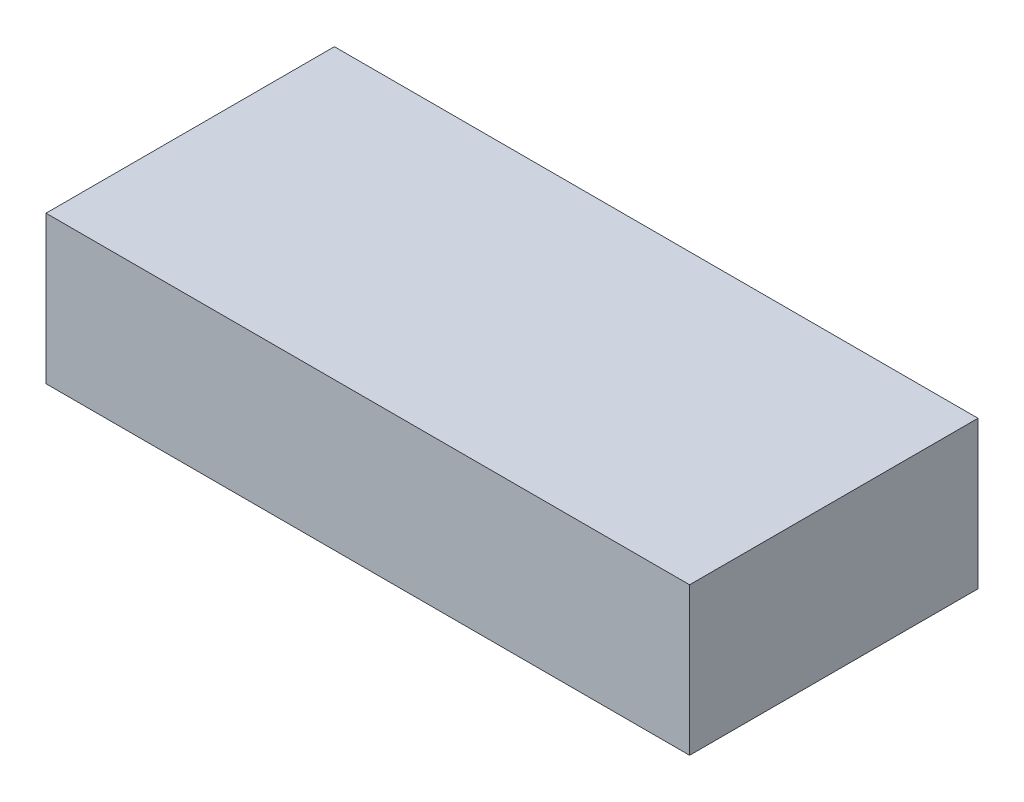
ISO-10303-21;
HEADER;
FILE_DESCRIPTION(('STEP AP214'),'2;1');
FILE_NAME('part.step','',(''),(''),'','','');
FILE_SCHEMA(('AUTOMOTIVE_DESIGN { 1 0 10303 214 1 1 1 1 }'));
ENDSEC;
DATA;
#1=APPLICATION_CONTEXT('core data for automotive mechanical design processes');
#2=APPLICATION_PROTOCOL_DEFINITION('international standard','automotive_design',2000,#1);
#3=PRODUCT_CONTEXT('',#1,'mechanical');
#4=PRODUCT('Part','Part','',(#3));
#5=PRODUCT_RELATED_PRODUCT_CATEGORY('part','',(#4));
#6=PRODUCT_DEFINITION_FORMATION('','',#4);
#7=PRODUCT_DEFINITION_CONTEXT('part definition',#1,'design');
#8=PRODUCT_DEFINITION('design','',#6,#7);
#9=PRODUCT_DEFINITION_SHAPE('','',#8);
#10=(LENGTH_UNIT() NAMED_UNIT(*) SI_UNIT(.MILLI.,.METRE.));
#11=(NAMED_UNIT(*) PLANE_ANGLE_UNIT() SI_UNIT($,.RADIAN.));
#12=(NAMED_UNIT(*) SI_UNIT($,.STERADIAN.) SOLID_ANGLE_UNIT());
#13=UNCERTAINTY_MEASURE_WITH_UNIT(LENGTH_MEASURE(1.E-05),#10,'distance_accuracy_value','');
#14=(GEOMETRIC_REPRESENTATION_CONTEXT(3) GLOBAL_UNCERTAINTY_ASSIGNED_CONTEXT((#13)) GLOBAL_UNIT_ASSIGNED_CONTEXT((#10,
#11,#12)) REPRESENTATION_CONTEXT('',''));
#15=CARTESIAN_POINT('',(0.,0.,0.));
#16=DIRECTION('',(0.,0.,1.));
#17=DIRECTION('',(1.,0.,0.));
#18=AXIS2_PLACEMENT_3D('',#15,#16,#17);
#19=CARTESIAN_POINT('',(0.,21.,0.));
#20=DIRECTION('',(1.,0.,0.));
#21=DIRECTION('',(0.,0.,-1.));
#22=AXIS2_PLACEMENT_3D('',#19,#20,#21);
#23=PLANE('',#22);
#24=DIRECTION('',(0.,0.,1.));
#25=VECTOR('',#24,1.);
#26=CARTESIAN_POINT('',(0.,0.,0.));
#27=LINE('',#26,#25);
#28=CARTESIAN_POINT('',(0.,0.,-41.));
#29=VERTEX_POINT('',#28);
#30=CARTESIAN_POINT('',(0.,0.,0.));
#31=VERTEX_POINT('',#30);
#32=EDGE_CURVE('E107',#29,#31,#27,.T.);
#33=ORIENTED_EDGE('',*,*,#32,.T.);
#34=DIRECTION('',(0.,-1.,0.));
#35=VECTOR('',#34,1.);
#36=CARTESIAN_POINT('',(0.,21.,0.));
#37=LINE('',#36,#35);
#38=CARTESIAN_POINT('',(0.,21.,0.));
#39=VERTEX_POINT('',#38);
#40=EDGE_CURVE('E11',#39,#31,#37,.T.);
#41=ORIENTED_EDGE('',*,*,#40,.F.);
#42=DIRECTION('',(0.,0.,1.));
#43=VECTOR('',#42,1.);
#44=CARTESIAN_POINT('',(0.,21.,0.));
#45=LINE('',#44,#43);
#46=CARTESIAN_POINT('',(0.,21.,-41.));
#47=VERTEX_POINT('',#46);
#48=EDGE_CURVE('E91',#47,#39,#45,.T.);
#49=ORIENTED_EDGE('',*,*,#48,.F.);
#50=DIRECTION('',(0.,-1.,0.));
#51=VECTOR('',#50,1.);
#52=CARTESIAN_POINT('',(0.,21.,-41.));
#53=LINE('',#52,#51);
#54=EDGE_CURVE('E103',#47,#29,#53,.T.);
#55=ORIENTED_EDGE('',*,*,#54,.T.);
#56=EDGE_LOOP('',(#33,#41,#49,#55));
#57=FACE_BOUND('',#56,.T.);
#58=ADVANCED_FACE('F39',(#57),#23,.F.);
#59=CARTESIAN_POINT('',(0.,21.,0.));
#60=DIRECTION('',(0.,0.,-1.));
#61=DIRECTION('',(-1.,0.,0.));
#62=AXIS2_PLACEMENT_3D('',#59,#60,#61);
#63=PLANE('',#62);
#64=DIRECTION('',(1.,0.,0.));
#65=VECTOR('',#64,1.);
#66=CARTESIAN_POINT('',(0.,0.,0.));
#67=LINE('',#66,#65);
#68=CARTESIAN_POINT('',(91.5,0.,0.));
#69=VERTEX_POINT('',#68);
#70=EDGE_CURVE('E96',#31,#69,#67,.T.);
#71=ORIENTED_EDGE('',*,*,#70,.T.);
#72=DIRECTION('',(0.,-1.,0.));
#73=VECTOR('',#72,1.);
#74=CARTESIAN_POINT('',(91.5,21.,0.));
#75=LINE('',#74,#73);
#76=CARTESIAN_POINT('',(91.5,21.,0.));
#77=VERTEX_POINT('',#76);
#78=EDGE_CURVE('E48',#77,#69,#75,.T.);
#79=ORIENTED_EDGE('',*,*,#78,.F.);
#80=DIRECTION('',(1.,0.,0.));
#81=VECTOR('',#80,1.);
#82=CARTESIAN_POINT('',(0.,21.,0.));
#83=LINE('',#82,#81);
#84=EDGE_CURVE('E86',#39,#77,#83,.T.);
#85=ORIENTED_EDGE('',*,*,#84,.F.);
#86=ORIENTED_EDGE('',*,*,#40,.T.);
#87=EDGE_LOOP('',(#71,#79,#85,#86));
#88=FACE_BOUND('',#87,.T.);
#89=ADVANCED_FACE('F95',(#88),#63,.F.);
#90=CARTESIAN_POINT('',(91.5,21.,0.));
#91=DIRECTION('',(-1.,0.,0.));
#92=DIRECTION('',(0.,0.,1.));
#93=AXIS2_PLACEMENT_3D('',#90,#91,#92);
#94=PLANE('',#93);
#95=DIRECTION('',(0.,0.,-1.));
#96=VECTOR('',#95,1.);
#97=CARTESIAN_POINT('',(91.5,0.,0.));
#98=LINE('',#97,#96);
#99=CARTESIAN_POINT('',(91.5,0.,-41.));
#100=VERTEX_POINT('',#99);
#101=EDGE_CURVE('E73',#69,#100,#98,.T.);
#102=ORIENTED_EDGE('',*,*,#101,.T.);
#103=DIRECTION('',(0.,-1.,0.));
#104=VECTOR('',#103,1.);
#105=CARTESIAN_POINT('',(91.5,21.,-41.));
#106=LINE('',#105,#104);
#107=CARTESIAN_POINT('',(91.5,21.,-41.));
#108=VERTEX_POINT('',#107);
#109=EDGE_CURVE('E98',#108,#100,#106,.T.);
#110=ORIENTED_EDGE('',*,*,#109,.F.);
#111=DIRECTION('',(0.,0.,-1.));
#112=VECTOR('',#111,1.);
#113=CARTESIAN_POINT('',(91.5,21.,0.));
#114=LINE('',#113,#112);
#115=EDGE_CURVE('E89',#77,#108,#114,.T.);
#116=ORIENTED_EDGE('',*,*,#115,.F.);
#117=ORIENTED_EDGE('',*,*,#78,.T.);
#118=EDGE_LOOP('',(#102,#110,#116,#117));
#119=FACE_BOUND('',#118,.T.);
#120=ADVANCED_FACE('F99',(#119),#94,.F.);
#121=CARTESIAN_POINT('',(0.,21.,-41.));
#122=DIRECTION('',(0.,0.,1.));
#123=DIRECTION('',(1.,0.,0.));
#124=AXIS2_PLACEMENT_3D('',#121,#122,#123);
#125=PLANE('',#124);
#126=DIRECTION('',(-1.,0.,0.));
#127=VECTOR('',#126,1.);
#128=CARTESIAN_POINT('',(0.,0.,-41.));
#129=LINE('',#128,#127);
#130=EDGE_CURVE('E79',#100,#29,#129,.T.);
#131=ORIENTED_EDGE('',*,*,#130,.T.);
#132=ORIENTED_EDGE('',*,*,#54,.F.);
#133=DIRECTION('',(-1.,0.,0.));
#134=VECTOR('',#133,1.);
#135=CARTESIAN_POINT('',(0.,21.,-41.));
#136=LINE('',#135,#134);
#137=EDGE_CURVE('E56',#108,#47,#136,.T.);
#138=ORIENTED_EDGE('',*,*,#137,.F.);
#139=ORIENTED_EDGE('',*,*,#109,.T.);
#140=EDGE_LOOP('',(#131,#132,#138,#139));
#141=FACE_BOUND('',#140,.T.);
#142=ADVANCED_FACE('F120',(#141),#125,.F.);
#143=CARTESIAN_POINT('',(0.,21.,0.));
#144=DIRECTION('',(0.,-1.,0.));
#145=DIRECTION('',(0.,0.,-1.));
#146=AXIS2_PLACEMENT_3D('',#143,#144,#145);
#147=PLANE('',#146);
#148=ORIENTED_EDGE('',*,*,#48,.T.);
#149=ORIENTED_EDGE('',*,*,#84,.T.);
#150=ORIENTED_EDGE('',*,*,#115,.T.);
#151=ORIENTED_EDGE('',*,*,#137,.T.);
#152=EDGE_LOOP('',(#148,#149,#150,#151));
#153=FACE_BOUND('',#152,.T.);
#154=ADVANCED_FACE('F87',(#153),#147,.F.);
#155=CARTESIAN_POINT('',(0.,0.,0.));
#156=DIRECTION('',(0.,-1.,0.));
#157=DIRECTION('',(0.,0.,-1.));
#158=AXIS2_PLACEMENT_3D('',#155,#156,#157);
#159=PLANE('',#158);
#160=ORIENTED_EDGE('',*,*,#32,.F.);
#161=ORIENTED_EDGE('',*,*,#130,.F.);
#162=ORIENTED_EDGE('',*,*,#101,.F.);
#163=ORIENTED_EDGE('',*,*,#70,.F.);
#164=EDGE_LOOP('',(#160,#161,#162,#163));
#165=FACE_BOUND('',#164,.T.);
#166=ADVANCED_FACE('F123',(#165),#159,.T.);
#167=CLOSED_SHELL('',(#58,#89,#120,#142,#154,#166));
#168=MANIFOLD_SOLID_BREP('B2',#167);
#169=ADVANCED_BREP_SHAPE_REPRESENTATION('',(#18,#168),#14);
#170=SHAPE_DEFINITION_REPRESENTATION(#9,#169);
ENDSEC;
END-ISO-10303-21;
